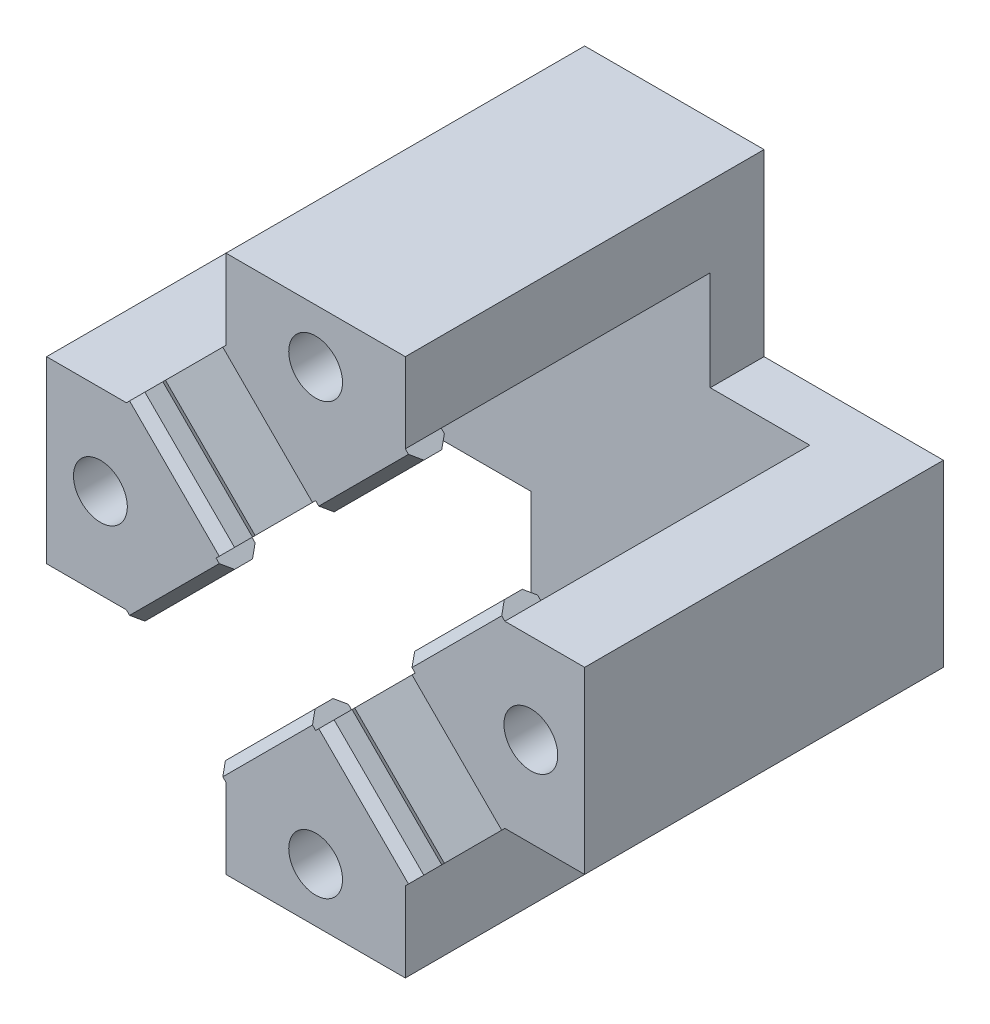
from build123d import *

# Parameters (mm, degrees)
ESQUISSE1_W                  = 10
ESQUISSE1_H                  = 10
BOSS_EXTRU_1_DEPTH           = 3
BOSS_EXTRU_2_DEPTH           = 17
ENL_V_MAT_EXTRU_1_DEPTH      = 33.739886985
ENL_V_MAT_EXTRU_1_DEPTH_BACK = 33.739886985
ESQUISSE3_R                  = 1.5
ESQUISSE4_W                  = 2
ESQUISSE4_H                  = 7.071067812
BOSS_EXTRU_3_DEPTH           = 0.75
ESQUISSE5_W                  = 2
ESQUISSE5_H                  = 7.071067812
BOSS_EXTRU_4_DEPTH           = 0.75
ESQUISSE6_W                  = 2
ESQUISSE6_H                  = 7.071067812
BOSS_EXTRU_5_DEPTH           = 0.75
ESQUISSE7_W                  = 2
ESQUISSE7_H                  = 7.071067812
BOSS_EXTRU_6_DEPTH           = 0.75
CHANFREIN1_SIZE              = 0.5


with BuildPart() as part:
    # Esquisse1 → Boss.-Extru.1 (new body)
    with BuildSketch(Plane.XY):
        with Locations((-0.268997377, -5.946549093)):
            Rectangle(ESQUISSE1_W, ESQUISSE1_H)
        with Locations((-10.268997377, -5.946549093)):
            Rectangle(ESQUISSE1_W, ESQUISSE1_H)
        with Locations((-0.268997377, 4.053450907)):
            Rectangle(ESQUISSE1_W, ESQUISSE1_H)
        with Locations((9.731002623, -5.946549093)):
            Rectangle(ESQUISSE1_W, ESQUISSE1_H)
        with Locations((-0.268997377, -15.946549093)):
            Rectangle(ESQUISSE1_W, ESQUISSE1_H)
    extrude(amount=BOSS_EXTRU_1_DEPTH)

    # Esquisse2 → Boss.-Extru.2 (add)
    with BuildSketch(Plane.XY.offset(3)):
        Polygon((-5.268997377, 4.603450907), (-0.268997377, -0.396549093), (4.731002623, 4.603450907), (4.731002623, 9.053450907), (-5.268997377, 9.053450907), align=None)
        Polygon((4.731002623, -20.946549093), (4.731002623, -16.496549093), (-0.268997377, -11.496549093), (-5.268997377, -16.496549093), (-5.268997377, -20.946549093), align=None)
        Polygon((-10.818997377, -0.946549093), (-5.818997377, -5.946549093), (-10.818997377, -10.946549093), (-15.268997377, -10.946549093), (-15.268997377, -0.946549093), align=None)
        Polygon((5.281002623, -5.946549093), (10.281002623, -10.946549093), (14.731002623, -10.946549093), (14.731002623, -0.946549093), (10.281002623, -0.946549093), align=None)
    extrude(amount=BOSS_EXTRU_2_DEPTH)

    # Esquisse3 → Enl_v. mat.-Extru.1 (cut, two sides: drawn at the far end of the back side and taken through both)
    with BuildSketch(Plane(origin=(0, 0, 0), x_dir=(-1, 0, 0), z_dir=(0, 0, -1)).offset(-ENL_V_MAT_EXTRU_1_DEPTH_BACK)):
        with Locations((0.268997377, 6.053450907)):
            Circle(ESQUISSE3_R)
        with Locations((-11.731002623, -5.946549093)):
            Circle(ESQUISSE3_R)
        with Locations((12.268997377, -5.946549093)):
            Circle(ESQUISSE3_R)
        with Locations((0.268997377, -17.946549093)):
            Circle(ESQUISSE3_R)
    extrude(amount=ENL_V_MAT_EXTRU_1_DEPTH + ENL_V_MAT_EXTRU_1_DEPTH_BACK, mode=Mode.SUBTRACT)

    # Esquisse4 → Boss.-Extru.3 (add)
    with BuildSketch(Plane(origin=(-0.332773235, -0.332773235, 0), x_dir=(0, 0, 1), z_dir=(-0.7071067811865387, -0.7071067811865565, 0))):
        with Locations((19, 3.445341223)):
            Rectangle(ESQUISSE4_W, ESQUISSE4_H)
        with Locations((19, -11.47461186)):
            Rectangle(ESQUISSE4_W, ESQUISSE4_H)
    extrude(amount=BOSS_EXTRU_3_DEPTH)

    # Esquisse5 → Boss.-Extru.4 (add)
    with BuildSketch(Plane(origin=(-5.882773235, -5.882773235, 0), x_dir=(0, 0, -1), z_dir=(0.7071067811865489, 0.7071067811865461, 0))):
        with Locations((-19, 3.445341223)):
            Rectangle(ESQUISSE5_W, ESQUISSE5_H)
        with Locations((-19, -11.47461186)):
            Rectangle(ESQUISSE5_W, ESQUISSE5_H)
    extrude(amount=BOSS_EXTRU_4_DEPTH)

    # Esquisse6 → Boss.-Extru.5 (add)
    with BuildSketch(Plane(origin=(5.613775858, -5.613775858, 0), x_dir=(0, 0, 1), z_dir=(-0.7071067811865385, 0.7071067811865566, 0))):
        with Locations((19, -11.855031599)):
            Rectangle(ESQUISSE6_W, ESQUISSE6_H)
        with Locations((19, 3.064921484)):
            Rectangle(ESQUISSE6_W, ESQUISSE6_H)
    extrude(amount=BOSS_EXTRU_5_DEPTH)

    # Esquisse7 → Boss.-Extru.6 (add)
    with BuildSketch(Plane(origin=(0.063775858, -0.063775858, 0), x_dir=(0, 0, -1), z_dir=(0.7071067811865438, -0.7071067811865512, 0))):
        with Locations((-19, -11.855031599)):
            Rectangle(ESQUISSE7_W, ESQUISSE7_H)
        with Locations((-19, 3.064921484)):
            Rectangle(ESQUISSE7_W, ESQUISSE7_H)
    extrude(amount=BOSS_EXTRU_6_DEPTH)

    # Chanfrein1
    chanfrein1_edges = [part.edges().sort_by_distance(p)[0] for p in [
        (-3.299327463, 1.573120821, 20),
        (-3.299327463, 1.573120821, 18),
        (7.250672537, -8.976879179, 20),
        (7.250672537, -8.976879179, 18),
        (-7.788667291, -2.916219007, 20),
        (-7.788667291, -2.916219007, 18),
        (2.761332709, -13.466219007, 20),
        (2.761332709, -13.466219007, 18),
        (-3.299327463, -13.466219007, 20),
        (-3.299327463, -13.466219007, 18),
        (7.250672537, -2.916219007, 20),
        (7.250672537, -2.916219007, 18),
        (-7.788667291, -8.976879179, 20),
        (-7.788667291, -8.976879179, 18),
        (2.761332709, 1.573120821, 20),
        (2.761332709, 1.573120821, 18),
    ]]
    chamfer(chanfrein1_edges, length=CHANFREIN1_SIZE)


solid = part.part
